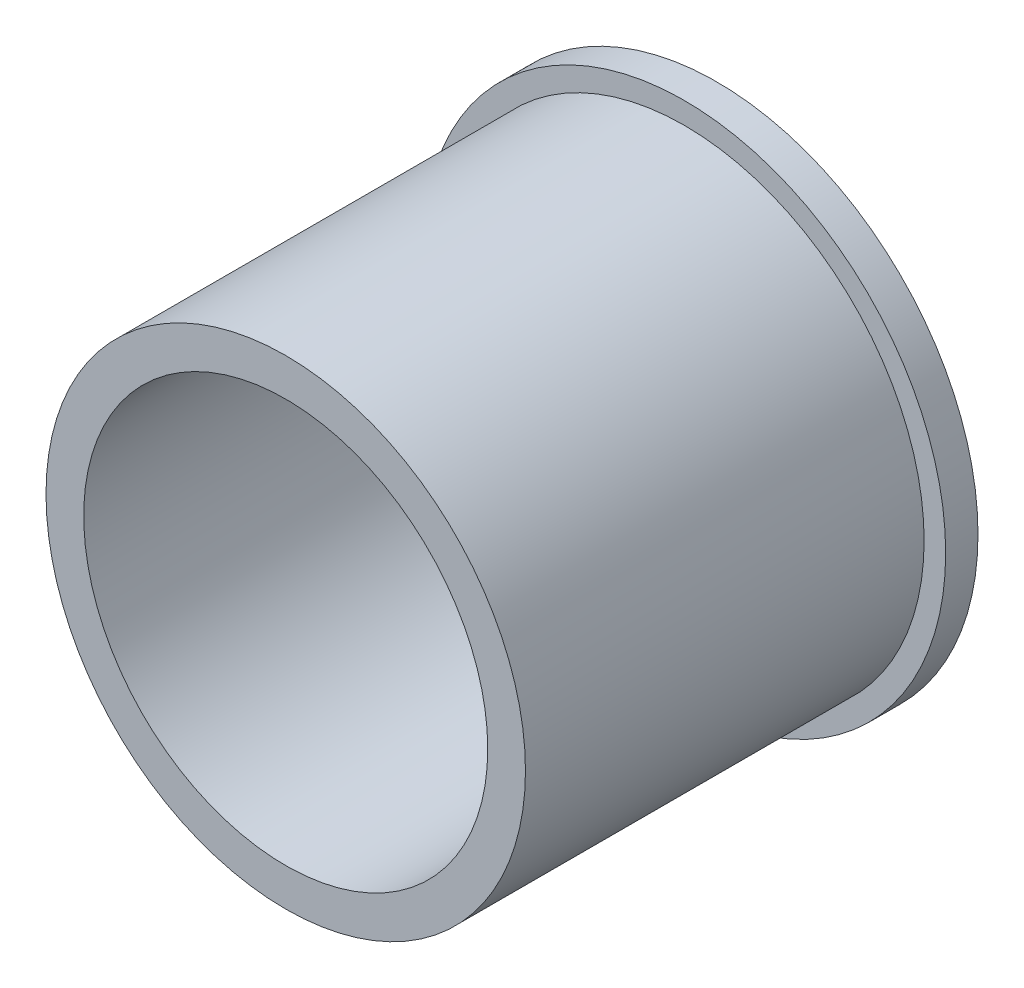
from build123d import *


with BuildPart() as part:
    # Sketch1 → Revolve1 (revolve)
    with BuildSketch(Plane(origin=(0, 0, 0), x_dir=(1, 0, 0), z_dir=(0, 1, 0)), mode=Mode.PRIVATE) as revolve1_sk:
        Polygon((-4.7625, -5.08), (-5.6515, -5.08), (-5.6515, 4.318), (-6.1595, 4.318), (-6.1595, 5.08), (-4.7625, 5.08), align=None)
    revolve(revolve1_sk.sketch.rotate(Axis((0, 0, 5.08), (0, 0, -1)), 180), axis=Axis((0, 0, 5.08), (0, 0, -1)))


solid = part.part
